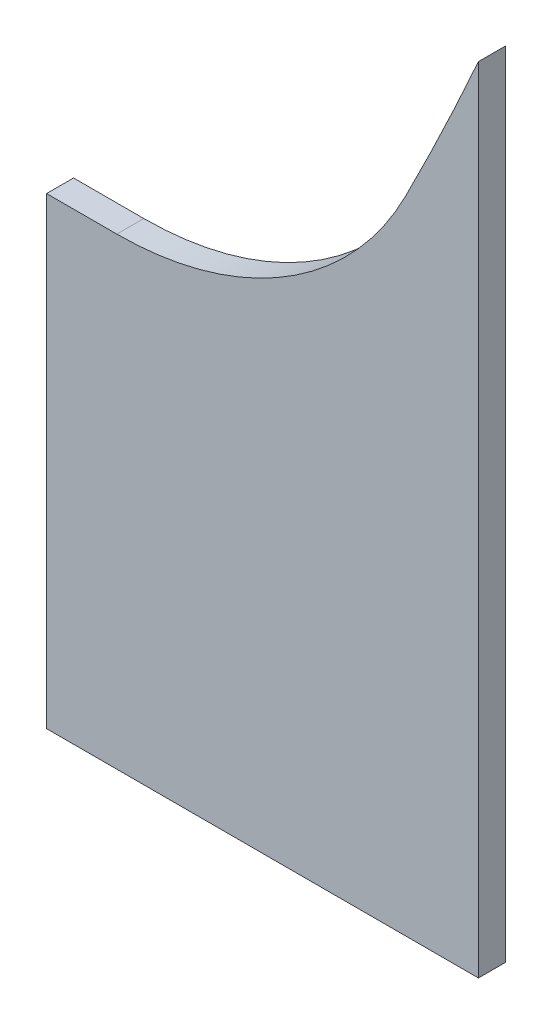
from build123d import *

# Parameters (mm, degrees)
EXTRUSION1_DEPTH      = 2.5
EXTRUSION1_DEPTH_BACK = 2.5


with BuildPart() as part:
    # Esquisse1 → Extrusion1 (new, two sides: drawn at the far end of the back side and taken through both)
    with BuildSketch(Plane.XY.offset(-EXTRUSION1_DEPTH_BACK)):
        with BuildLine():
            Line((577, -390.85), (657, -390.85))
            Line((657, -390.85), (657, -243.828214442))
            ThreePointArc((657, -243.828214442), (650.420668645, -258.113897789), (643.469155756, -272.222222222))
            ThreePointArc((643.469155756, -272.222222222), (621.358146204, -296.153364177), (590, -305))
            Line((590, -305), (577, -305))
            Line((577, -305), (577, -390.85))
        make_face()
    extrude(amount=EXTRUSION1_DEPTH + EXTRUSION1_DEPTH_BACK)


solid = part.part
